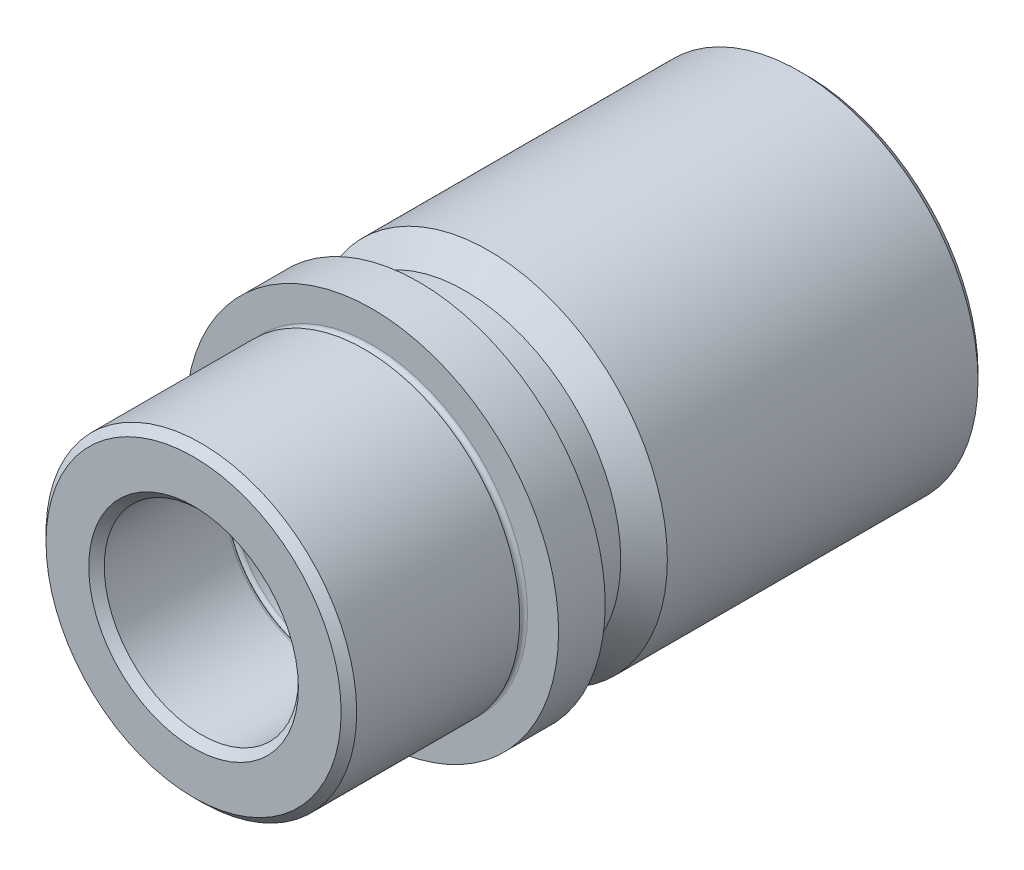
ISO-10303-21;
HEADER;
FILE_DESCRIPTION(('STEP AP214'),'2;1');
FILE_NAME('part.step','',(''),(''),'','','');
FILE_SCHEMA(('AUTOMOTIVE_DESIGN { 1 0 10303 214 1 1 1 1 }'));
ENDSEC;
DATA;
#1=APPLICATION_CONTEXT('core data for automotive mechanical design processes');
#2=APPLICATION_PROTOCOL_DEFINITION('international standard','automotive_design',2000,#1);
#3=PRODUCT_CONTEXT('',#1,'mechanical');
#4=PRODUCT('Part','Part','',(#3));
#5=PRODUCT_RELATED_PRODUCT_CATEGORY('part','',(#4));
#6=PRODUCT_DEFINITION_FORMATION('','',#4);
#7=PRODUCT_DEFINITION_CONTEXT('part definition',#1,'design');
#8=PRODUCT_DEFINITION('design','',#6,#7);
#9=PRODUCT_DEFINITION_SHAPE('','',#8);
#10=(LENGTH_UNIT() NAMED_UNIT(*) SI_UNIT(.MILLI.,.METRE.));
#11=(NAMED_UNIT(*) PLANE_ANGLE_UNIT() SI_UNIT($,.RADIAN.));
#12=(NAMED_UNIT(*) SI_UNIT($,.STERADIAN.) SOLID_ANGLE_UNIT());
#13=UNCERTAINTY_MEASURE_WITH_UNIT(LENGTH_MEASURE(1.E-05),#10,'distance_accuracy_value','');
#14=(GEOMETRIC_REPRESENTATION_CONTEXT(3) GLOBAL_UNCERTAINTY_ASSIGNED_CONTEXT((#13)) GLOBAL_UNIT_ASSIGNED_CONTEXT((#10,
#11,#12)) REPRESENTATION_CONTEXT('',''));
#15=CARTESIAN_POINT('',(0.,0.,0.));
#16=DIRECTION('',(0.,0.,1.));
#17=DIRECTION('',(1.,0.,0.));
#18=AXIS2_PLACEMENT_3D('',#15,#16,#17);
#19=CARTESIAN_POINT('',(0.,0.,-41.5));
#20=DIRECTION('',(0.,0.,1.));
#21=DIRECTION('',(1.,0.,0.));
#22=AXIS2_PLACEMENT_3D('',#19,#20,#21);
#23=TOROIDAL_SURFACE('',#22,13.,0.5);
#24=CARTESIAN_POINT('',(0.,0.,-41.5));
#25=DIRECTION('',(0.,0.,1.));
#26=DIRECTION('',(1.,0.,0.));
#27=AXIS2_PLACEMENT_3D('',#24,#25,#26);
#28=CIRCLE('',#27,12.5);
#29=CARTESIAN_POINT('',(12.5,0.,-41.5));
#30=VERTEX_POINT('',#29);
#31=EDGE_CURVE('E81',#30,#30,#28,.T.);
#32=ORIENTED_EDGE('',*,*,#31,.T.);
#33=EDGE_LOOP('',(#32));
#34=FACE_BOUND('',#33,.T.);
#35=CARTESIAN_POINT('',(0.,0.,-42.));
#36=DIRECTION('',(0.,0.,1.));
#37=DIRECTION('',(1.,0.,0.));
#38=AXIS2_PLACEMENT_3D('',#35,#36,#37);
#39=CIRCLE('',#38,13.);
#40=CARTESIAN_POINT('',(13.,0.,-42.));
#41=VERTEX_POINT('',#40);
#42=EDGE_CURVE('E45',#41,#41,#39,.T.);
#43=ORIENTED_EDGE('',*,*,#42,.F.);
#44=EDGE_LOOP('',(#43));
#45=FACE_BOUND('',#44,.T.);
#46=ADVANCED_FACE('F13',(#34,#45),#23,.T.);
#47=CARTESIAN_POINT('',(0.,0.,-42.5));
#48=DIRECTION('',(0.,0.,1.));
#49=DIRECTION('',(1.,0.,0.));
#50=AXIS2_PLACEMENT_3D('',#47,#48,#49);
#51=TOROIDAL_SURFACE('',#50,13.,0.5);
#52=CARTESIAN_POINT('',(0.,0.,-42.5));
#53=DIRECTION('',(0.,0.,1.));
#54=DIRECTION('',(1.,0.,0.));
#55=AXIS2_PLACEMENT_3D('',#52,#53,#54);
#56=CIRCLE('',#55,12.5);
#57=CARTESIAN_POINT('',(12.5,0.,-42.5));
#58=VERTEX_POINT('',#57);
#59=EDGE_CURVE('E48',#58,#58,#56,.T.);
#60=ORIENTED_EDGE('',*,*,#59,.F.);
#61=EDGE_LOOP('',(#60));
#62=FACE_BOUND('',#61,.T.);
#63=ORIENTED_EDGE('',*,*,#42,.T.);
#64=EDGE_LOOP('',(#63));
#65=FACE_BOUND('',#64,.T.);
#66=ADVANCED_FACE('F113',(#62,#65),#51,.T.);
#67=CARTESIAN_POINT('',(0.,0.,0.));
#68=DIRECTION('',(0.,0.,1.));
#69=DIRECTION('',(1.,0.,0.));
#70=AXIS2_PLACEMENT_3D('',#67,#68,#69);
#71=CYLINDRICAL_SURFACE('',#70,12.5);
#72=CARTESIAN_POINT('',(0.,0.,-78.));
#73=DIRECTION('',(0.,0.,1.));
#74=DIRECTION('',(1.,0.,0.));
#75=AXIS2_PLACEMENT_3D('',#72,#73,#74);
#76=CIRCLE('',#75,12.5);
#77=CARTESIAN_POINT('',(12.5,0.,-78.));
#78=VERTEX_POINT('',#77);
#79=EDGE_CURVE('E36',#78,#78,#76,.F.);
#80=ORIENTED_EDGE('',*,*,#79,.T.);
#81=EDGE_LOOP('',(#80));
#82=FACE_BOUND('',#81,.T.);
#83=ORIENTED_EDGE('',*,*,#59,.T.);
#84=EDGE_LOOP('',(#83));
#85=FACE_BOUND('',#84,.T.);
#86=ADVANCED_FACE('F118',(#82,#85),#71,.F.);
#87=CARTESIAN_POINT('',(0.,0.,-79.));
#88=DIRECTION('',(0.,0.,1.));
#89=DIRECTION('',(1.,0.,0.));
#90=AXIS2_PLACEMENT_3D('',#87,#88,#89);
#91=PLANE('',#90);
#92=CARTESIAN_POINT('',(0.,0.,-79.));
#93=DIRECTION('',(0.,0.,1.));
#94=DIRECTION('',(1.,0.,0.));
#95=AXIS2_PLACEMENT_3D('',#92,#93,#94);
#96=CIRCLE('',#95,13.5);
#97=CARTESIAN_POINT('',(13.5,0.,-79.));
#98=VERTEX_POINT('',#97);
#99=EDGE_CURVE('E39',#98,#98,#96,.T.);
#100=ORIENTED_EDGE('',*,*,#99,.T.);
#101=EDGE_LOOP('',(#100));
#102=FACE_BOUND('',#101,.T.);
#103=CARTESIAN_POINT('',(0.,0.,-79.));
#104=DIRECTION('',(0.,0.,1.));
#105=DIRECTION('',(1.,0.,0.));
#106=AXIS2_PLACEMENT_3D('',#103,#104,#105);
#107=CIRCLE('',#106,22.);
#108=CARTESIAN_POINT('',(22.,0.,-79.));
#109=VERTEX_POINT('',#108);
#110=EDGE_CURVE('E42',#109,#109,#107,.F.);
#111=ORIENTED_EDGE('',*,*,#110,.T.);
#112=EDGE_LOOP('',(#111));
#113=FACE_BOUND('',#112,.T.);
#114=ADVANCED_FACE('F185',(#102,#113),#91,.F.);
#115=CARTESIAN_POINT('',(0.,0.,0.));
#116=DIRECTION('',(0.,0.,1.));
#117=DIRECTION('',(1.,0.,0.));
#118=AXIS2_PLACEMENT_3D('',#115,#116,#117);
#119=CYLINDRICAL_SURFACE('',#118,23.);
#120=CARTESIAN_POINT('',(0.,0.,-78.));
#121=DIRECTION('',(0.,0.,1.));
#122=DIRECTION('',(1.,0.,0.));
#123=AXIS2_PLACEMENT_3D('',#120,#121,#122);
#124=CIRCLE('',#123,23.);
#125=CARTESIAN_POINT('',(23.,0.,-78.));
#126=VERTEX_POINT('',#125);
#127=EDGE_CURVE('E33',#126,#126,#124,.T.);
#128=ORIENTED_EDGE('',*,*,#127,.T.);
#129=EDGE_LOOP('',(#128));
#130=FACE_BOUND('',#129,.T.);
#131=CARTESIAN_POINT('',(0.,0.,-38.));
#132=DIRECTION('',(0.,0.,1.));
#133=DIRECTION('',(1.,0.,0.));
#134=AXIS2_PLACEMENT_3D('',#131,#132,#133);
#135=CIRCLE('',#134,23.);
#136=CARTESIAN_POINT('',(23.,0.,-38.));
#137=VERTEX_POINT('',#136);
#138=EDGE_CURVE('E51',#137,#137,#135,.T.);
#139=ORIENTED_EDGE('',*,*,#138,.F.);
#140=EDGE_LOOP('',(#139));
#141=FACE_BOUND('',#140,.T.);
#142=ADVANCED_FACE('F181',(#130,#141),#119,.T.);
#143=CARTESIAN_POINT('',(0.,0.,-35.));
#144=DIRECTION('',(0.,0.,-1.));
#145=DIRECTION('',(-1.,0.,0.));
#146=AXIS2_PLACEMENT_3D('',#143,#144,#145);
#147=CONICAL_SURFACE('',#146,20.,0.78539816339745);
#148=ORIENTED_EDGE('',*,*,#138,.T.);
#149=EDGE_LOOP('',(#148));
#150=FACE_BOUND('',#149,.T.);
#151=CARTESIAN_POINT('',(0.,0.,-35.));
#152=DIRECTION('',(0.,0.,1.));
#153=DIRECTION('',(1.,0.,0.));
#154=AXIS2_PLACEMENT_3D('',#151,#152,#153);
#155=CIRCLE('',#154,20.);
#156=CARTESIAN_POINT('',(20.,0.,-35.));
#157=VERTEX_POINT('',#156);
#158=EDGE_CURVE('E54',#157,#157,#155,.T.);
#159=ORIENTED_EDGE('',*,*,#158,.F.);
#160=EDGE_LOOP('',(#159));
#161=FACE_BOUND('',#160,.T.);
#162=ADVANCED_FACE('F177',(#150,#161),#147,.T.);
#163=CARTESIAN_POINT('',(0.,0.,0.));
#164=DIRECTION('',(0.,0.,1.));
#165=DIRECTION('',(1.,0.,0.));
#166=AXIS2_PLACEMENT_3D('',#163,#164,#165);
#167=CYLINDRICAL_SURFACE('',#166,20.);
#168=ORIENTED_EDGE('',*,*,#158,.T.);
#169=EDGE_LOOP('',(#168));
#170=FACE_BOUND('',#169,.T.);
#171=CARTESIAN_POINT('',(0.,0.,-29.));
#172=DIRECTION('',(0.,0.,1.));
#173=DIRECTION('',(1.,0.,0.));
#174=AXIS2_PLACEMENT_3D('',#171,#172,#173);
#175=CIRCLE('',#174,20.);
#176=CARTESIAN_POINT('',(20.,0.,-29.));
#177=VERTEX_POINT('',#176);
#178=EDGE_CURVE('E57',#177,#177,#175,.T.);
#179=ORIENTED_EDGE('',*,*,#178,.F.);
#180=EDGE_LOOP('',(#179));
#181=FACE_BOUND('',#180,.T.);
#182=ADVANCED_FACE('F173',(#170,#181),#167,.T.);
#183=CARTESIAN_POINT('',(0.,0.,-29.));
#184=DIRECTION('',(0.,0.,-1.));
#185=DIRECTION('',(-1.,0.,0.));
#186=AXIS2_PLACEMENT_3D('',#183,#184,#185);
#187=PLANE('',#186);
#188=ORIENTED_EDGE('',*,*,#178,.T.);
#189=EDGE_LOOP('',(#188));
#190=FACE_BOUND('',#189,.T.);
#191=CARTESIAN_POINT('',(0.,0.,-29.));
#192=DIRECTION('',(0.,0.,1.));
#193=DIRECTION('',(1.,0.,0.));
#194=AXIS2_PLACEMENT_3D('',#191,#192,#193);
#195=CIRCLE('',#194,24.);
#196=CARTESIAN_POINT('',(24.,0.,-29.));
#197=VERTEX_POINT('',#196);
#198=EDGE_CURVE('E60',#197,#197,#195,.T.);
#199=ORIENTED_EDGE('',*,*,#198,.F.);
#200=EDGE_LOOP('',(#199));
#201=FACE_BOUND('',#200,.T.);
#202=ADVANCED_FACE('F169',(#190,#201),#187,.T.);
#203=CARTESIAN_POINT('',(0.,0.,0.));
#204=DIRECTION('',(0.,0.,1.));
#205=DIRECTION('',(1.,0.,0.));
#206=AXIS2_PLACEMENT_3D('',#203,#204,#205);
#207=CYLINDRICAL_SURFACE('',#206,24.);
#208=ORIENTED_EDGE('',*,*,#198,.T.);
#209=EDGE_LOOP('',(#208));
#210=FACE_BOUND('',#209,.T.);
#211=CARTESIAN_POINT('',(0.,0.,-23.));
#212=DIRECTION('',(0.,0.,1.));
#213=DIRECTION('',(1.,0.,0.));
#214=AXIS2_PLACEMENT_3D('',#211,#212,#213);
#215=CIRCLE('',#214,24.);
#216=CARTESIAN_POINT('',(24.,0.,-23.));
#217=VERTEX_POINT('',#216);
#218=EDGE_CURVE('E63',#217,#217,#215,.T.);
#219=ORIENTED_EDGE('',*,*,#218,.F.);
#220=EDGE_LOOP('',(#219));
#221=FACE_BOUND('',#220,.T.);
#222=ADVANCED_FACE('F165',(#210,#221),#207,.T.);
#223=CARTESIAN_POINT('',(0.,0.,-23.));
#224=DIRECTION('',(0.,0.,1.));
#225=DIRECTION('',(1.,0.,0.));
#226=AXIS2_PLACEMENT_3D('',#223,#224,#225);
#227=PLANE('',#226);
#228=ORIENTED_EDGE('',*,*,#218,.T.);
#229=EDGE_LOOP('',(#228));
#230=FACE_BOUND('',#229,.T.);
#231=CARTESIAN_POINT('',(0.,0.,-23.));
#232=DIRECTION('',(0.,0.,1.));
#233=DIRECTION('',(1.,0.,0.));
#234=AXIS2_PLACEMENT_3D('',#231,#232,#233);
#235=CIRCLE('',#234,20.);
#236=CARTESIAN_POINT('',(20.,0.,-23.));
#237=VERTEX_POINT('',#236);
#238=EDGE_CURVE('E66',#237,#237,#235,.T.);
#239=ORIENTED_EDGE('',*,*,#238,.F.);
#240=EDGE_LOOP('',(#239));
#241=FACE_BOUND('',#240,.T.);
#242=ADVANCED_FACE('F161',(#230,#241),#227,.T.);
#243=CARTESIAN_POINT('',(0.,0.,-22.5));
#244=DIRECTION('',(0.,0.,1.));
#245=DIRECTION('',(1.,0.,0.));
#246=AXIS2_PLACEMENT_3D('',#243,#244,#245);
#247=TOROIDAL_SURFACE('',#246,20.,0.5);
#248=ORIENTED_EDGE('',*,*,#238,.T.);
#249=EDGE_LOOP('',(#248));
#250=FACE_BOUND('',#249,.T.);
#251=CARTESIAN_POINT('',(0.,0.,-22.));
#252=DIRECTION('',(0.,0.,1.));
#253=DIRECTION('',(1.,0.,0.));
#254=AXIS2_PLACEMENT_3D('',#251,#252,#253);
#255=CIRCLE('',#254,20.);
#256=CARTESIAN_POINT('',(20.,0.,-22.));
#257=VERTEX_POINT('',#256);
#258=EDGE_CURVE('E69',#257,#257,#255,.T.);
#259=ORIENTED_EDGE('',*,*,#258,.F.);
#260=EDGE_LOOP('',(#259));
#261=FACE_BOUND('',#260,.T.);
#262=ADVANCED_FACE('F156',(#250,#261),#247,.F.);
#263=CARTESIAN_POINT('',(0.,0.,0.));
#264=DIRECTION('',(0.,0.,1.));
#265=DIRECTION('',(1.,0.,0.));
#266=AXIS2_PLACEMENT_3D('',#263,#264,#265);
#267=CYLINDRICAL_SURFACE('',#266,20.);
#268=CARTESIAN_POINT('',(0.,0.,-0.99999999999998));
#269=DIRECTION('',(0.,0.,1.));
#270=DIRECTION('',(1.,0.,0.));
#271=AXIS2_PLACEMENT_3D('',#268,#269,#270);
#272=CIRCLE('',#271,20.);
#273=CARTESIAN_POINT('',(20.,0.,-0.99999999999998));
#274=VERTEX_POINT('',#273);
#275=EDGE_CURVE('E8',#274,#274,#272,.F.);
#276=ORIENTED_EDGE('',*,*,#275,.T.);
#277=EDGE_LOOP('',(#276));
#278=FACE_BOUND('',#277,.T.);
#279=ORIENTED_EDGE('',*,*,#258,.T.);
#280=EDGE_LOOP('',(#279));
#281=FACE_BOUND('',#280,.T.);
#282=ADVANCED_FACE('F149',(#278,#281),#267,.T.);
#283=CARTESIAN_POINT('',(0.,0.,0.));
#284=DIRECTION('',(0.,0.,1.));
#285=DIRECTION('',(1.,0.,0.));
#286=AXIS2_PLACEMENT_3D('',#283,#284,#285);
#287=PLANE('',#286);
#288=CARTESIAN_POINT('',(0.,0.,0.));
#289=DIRECTION('',(0.,0.,1.));
#290=DIRECTION('',(1.,0.,0.));
#291=AXIS2_PLACEMENT_3D('',#288,#289,#290);
#292=CIRCLE('',#291,13.5);
#293=CARTESIAN_POINT('',(13.5,0.,0.));
#294=VERTEX_POINT('',#293);
#295=EDGE_CURVE('E20',#294,#294,#292,.F.);
#296=ORIENTED_EDGE('',*,*,#295,.T.);
#297=EDGE_LOOP('',(#296));
#298=FACE_BOUND('',#297,.T.);
#299=CARTESIAN_POINT('',(0.,0.,0.));
#300=DIRECTION('',(0.,0.,1.));
#301=DIRECTION('',(1.,0.,0.));
#302=AXIS2_PLACEMENT_3D('',#299,#300,#301);
#303=CIRCLE('',#302,19.);
#304=CARTESIAN_POINT('',(19.,0.,0.));
#305=VERTEX_POINT('',#304);
#306=EDGE_CURVE('E24',#305,#305,#303,.T.);
#307=ORIENTED_EDGE('',*,*,#306,.T.);
#308=EDGE_LOOP('',(#307));
#309=FACE_BOUND('',#308,.T.);
#310=ADVANCED_FACE('F109',(#298,#309),#287,.T.);
#311=CARTESIAN_POINT('',(0.,0.,0.));
#312=DIRECTION('',(0.,0.,1.));
#313=DIRECTION('',(1.,0.,0.));
#314=AXIS2_PLACEMENT_3D('',#311,#312,#313);
#315=CYLINDRICAL_SURFACE('',#314,12.5);
#316=CARTESIAN_POINT('',(0.,0.,-0.999999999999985));
#317=DIRECTION('',(0.,0.,1.));
#318=DIRECTION('',(1.,0.,0.));
#319=AXIS2_PLACEMENT_3D('',#316,#317,#318);
#320=CIRCLE('',#319,12.5);
#321=CARTESIAN_POINT('',(12.5,0.,-0.999999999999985));
#322=VERTEX_POINT('',#321);
#323=EDGE_CURVE('E28',#322,#322,#320,.T.);
#324=ORIENTED_EDGE('',*,*,#323,.T.);
#325=EDGE_LOOP('',(#324));
#326=FACE_BOUND('',#325,.T.);
#327=CARTESIAN_POINT('',(0.,0.,-16.5));
#328=DIRECTION('',(0.,0.,1.));
#329=DIRECTION('',(1.,0.,0.));
#330=AXIS2_PLACEMENT_3D('',#327,#328,#329);
#331=CIRCLE('',#330,12.5);
#332=CARTESIAN_POINT('',(12.5,0.,-16.5));
#333=VERTEX_POINT('',#332);
#334=EDGE_CURVE('E72',#333,#333,#331,.T.);
#335=ORIENTED_EDGE('',*,*,#334,.F.);
#336=EDGE_LOOP('',(#335));
#337=FACE_BOUND('',#336,.T.);
#338=ADVANCED_FACE('F102',(#326,#337),#315,.F.);
#339=CARTESIAN_POINT('',(0.,0.,-16.5));
#340=DIRECTION('',(0.,0.,1.));
#341=DIRECTION('',(1.,0.,0.));
#342=AXIS2_PLACEMENT_3D('',#339,#340,#341);
#343=TOROIDAL_SURFACE('',#342,13.,0.5);
#344=ORIENTED_EDGE('',*,*,#334,.T.);
#345=EDGE_LOOP('',(#344));
#346=FACE_BOUND('',#345,.T.);
#347=CARTESIAN_POINT('',(0.,0.,-17.));
#348=DIRECTION('',(0.,0.,1.));
#349=DIRECTION('',(1.,0.,0.));
#350=AXIS2_PLACEMENT_3D('',#347,#348,#349);
#351=CIRCLE('',#350,13.);
#352=CARTESIAN_POINT('',(13.,0.,-17.));
#353=VERTEX_POINT('',#352);
#354=EDGE_CURVE('E75',#353,#353,#351,.T.);
#355=ORIENTED_EDGE('',*,*,#354,.F.);
#356=EDGE_LOOP('',(#355));
#357=FACE_BOUND('',#356,.T.);
#358=ADVANCED_FACE('F97',(#346,#357),#343,.T.);
#359=CARTESIAN_POINT('',(0.,0.,-17.5));
#360=DIRECTION('',(0.,0.,1.));
#361=DIRECTION('',(1.,0.,0.));
#362=AXIS2_PLACEMENT_3D('',#359,#360,#361);
#363=TOROIDAL_SURFACE('',#362,13.,0.5);
#364=CARTESIAN_POINT('',(0.,0.,-17.5));
#365=DIRECTION('',(0.,0.,1.));
#366=DIRECTION('',(1.,0.,0.));
#367=AXIS2_PLACEMENT_3D('',#364,#365,#366);
#368=CIRCLE('',#367,12.5);
#369=CARTESIAN_POINT('',(12.5,0.,-17.5));
#370=VERTEX_POINT('',#369);
#371=EDGE_CURVE('E78',#370,#370,#368,.T.);
#372=ORIENTED_EDGE('',*,*,#371,.F.);
#373=EDGE_LOOP('',(#372));
#374=FACE_BOUND('',#373,.T.);
#375=ORIENTED_EDGE('',*,*,#354,.T.);
#376=EDGE_LOOP('',(#375));
#377=FACE_BOUND('',#376,.T.);
#378=ADVANCED_FACE('F91',(#374,#377),#363,.T.);
#379=CARTESIAN_POINT('',(0.,0.,0.));
#380=DIRECTION('',(0.,0.,1.));
#381=DIRECTION('',(1.,0.,0.));
#382=AXIS2_PLACEMENT_3D('',#379,#380,#381);
#383=CYLINDRICAL_SURFACE('',#382,12.5);
#384=ORIENTED_EDGE('',*,*,#31,.F.);
#385=EDGE_LOOP('',(#384));
#386=FACE_BOUND('',#385,.T.);
#387=ORIENTED_EDGE('',*,*,#371,.T.);
#388=EDGE_LOOP('',(#387));
#389=FACE_BOUND('',#388,.T.);
#390=ADVANCED_FACE('F87',(#386,#389),#383,.F.);
#391=CARTESIAN_POINT('',(0.,0.,-79.));
#392=DIRECTION('',(0.,0.,-1.));
#393=DIRECTION('',(-1.,0.,0.));
#394=AXIS2_PLACEMENT_3D('',#391,#392,#393);
#395=CONICAL_SURFACE('',#394,13.5,0.785398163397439);
#396=ORIENTED_EDGE('',*,*,#79,.F.);
#397=EDGE_LOOP('',(#396));
#398=FACE_BOUND('',#397,.T.);
#399=ORIENTED_EDGE('',*,*,#99,.F.);
#400=EDGE_LOOP('',(#399));
#401=FACE_BOUND('',#400,.T.);
#402=ADVANCED_FACE('F90',(#398,#401),#395,.F.);
#403=CARTESIAN_POINT('',(0.,0.,-78.));
#404=DIRECTION('',(0.,0.,1.));
#405=DIRECTION('',(1.,0.,0.));
#406=AXIS2_PLACEMENT_3D('',#403,#404,#405);
#407=CONICAL_SURFACE('',#406,23.,0.785398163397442);
#408=ORIENTED_EDGE('',*,*,#110,.F.);
#409=EDGE_LOOP('',(#408));
#410=FACE_BOUND('',#409,.T.);
#411=ORIENTED_EDGE('',*,*,#127,.F.);
#412=EDGE_LOOP('',(#411));
#413=FACE_BOUND('',#412,.T.);
#414=ADVANCED_FACE('F125',(#410,#413),#407,.T.);
#415=CARTESIAN_POINT('',(0.,0.,-0.999999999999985));
#416=DIRECTION('',(0.,0.,1.));
#417=DIRECTION('',(1.,0.,0.));
#418=AXIS2_PLACEMENT_3D('',#415,#416,#417);
#419=CONICAL_SURFACE('',#418,12.5,0.785398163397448);
#420=ORIENTED_EDGE('',*,*,#295,.F.);
#421=EDGE_LOOP('',(#420));
#422=FACE_BOUND('',#421,.T.);
#423=ORIENTED_EDGE('',*,*,#323,.F.);
#424=EDGE_LOOP('',(#423));
#425=FACE_BOUND('',#424,.T.);
#426=ADVANCED_FACE('F128',(#422,#425),#419,.F.);
#427=CARTESIAN_POINT('',(0.,0.,0.));
#428=DIRECTION('',(0.,0.,-1.));
#429=DIRECTION('',(-1.,0.,0.));
#430=AXIS2_PLACEMENT_3D('',#427,#428,#429);
#431=CONICAL_SURFACE('',#430,19.,0.785398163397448);
#432=ORIENTED_EDGE('',*,*,#275,.F.);
#433=EDGE_LOOP('',(#432));
#434=FACE_BOUND('',#433,.T.);
#435=ORIENTED_EDGE('',*,*,#306,.F.);
#436=EDGE_LOOP('',(#435));
#437=FACE_BOUND('',#436,.T.);
#438=ADVANCED_FACE('F15',(#434,#437),#431,.T.);
#439=CLOSED_SHELL('',(#46,#66,#86,#114,#142,#162,#182,#202,#222,#242,#262,#282,#310,#338,#358,
#378,#390,#402,#414,#426,#438));
#440=MANIFOLD_SOLID_BREP('B1',#439);
#441=ADVANCED_BREP_SHAPE_REPRESENTATION('',(#18,#440),#14);
#442=SHAPE_DEFINITION_REPRESENTATION(#9,#441);
ENDSEC;
END-ISO-10303-21;
